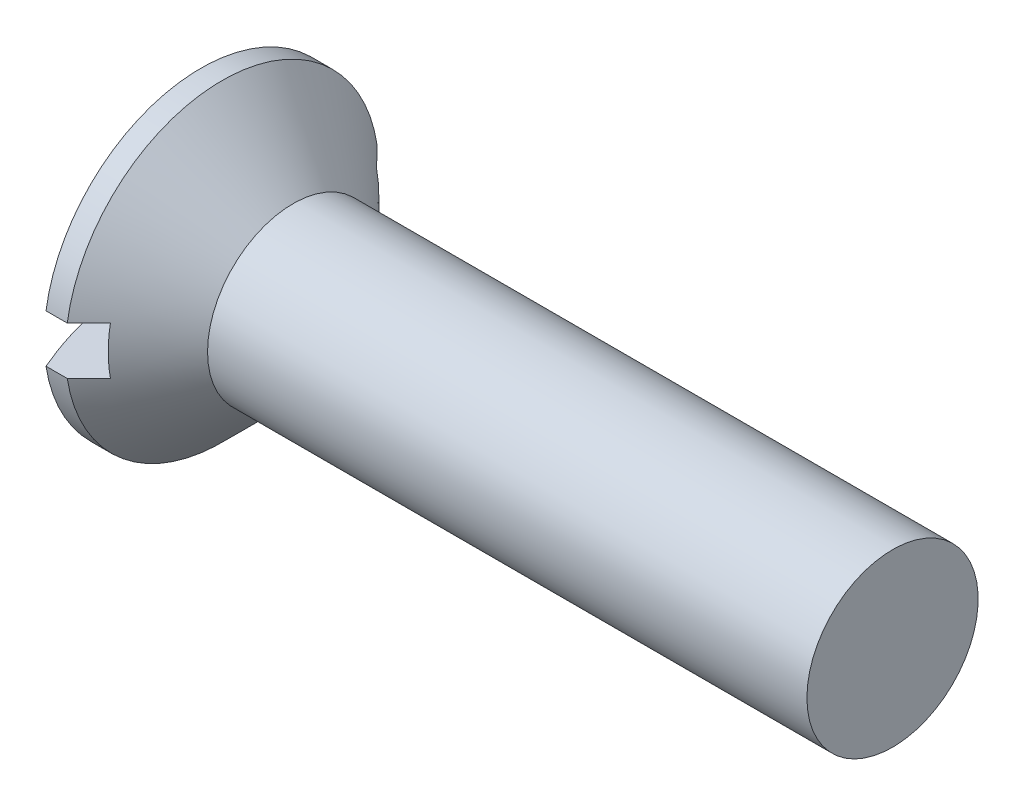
from build123d import *

# Parameters (mm, degrees)
SKETCH2_W         = 18.3
SKETCH2_H         = 2.8
SLOT_DEPTH        = 4.4
CIRPATTERN1_COUNT = 2
CIRPATTERN1_ANGLE = 90


with BuildPart() as part:
    # BodySke → Base-Revolve (revolve)
    with BuildSketch(Plane.XY, mode=Mode.PRIVATE) as base_revolve_sk:
        with BuildLine():
            Line((0, 0), (42.298786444, 0))
            Line((42.298786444, 0), (42.298786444, 5))
            Line((42.298786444, 5), (7.298786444, 5))
            Line((7.298786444, 5), (3.148786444, 9.15))
            Line((3.148786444, 9.15), (1.907441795, 9.15))
            ThreePointArc((1.907441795, 9.15), (0.481931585, 4.673350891), (0, 0))
        make_face()
    revolve(base_revolve_sk.sketch.rotate(Axis((-15.875, 0, 0), (1, 0, 0)), 90), axis=Axis((-15.875, 0, 0), (1, 0, 0)))

    # Sketch2 → Slot (cut)
    with BuildSketch(Plane(origin=(0, 0, 0), x_dir=(0, 0, -1), z_dir=(1, 0, 0))):
        Rectangle(SKETCH2_W, SKETCH2_H)
    extrude(amount=SLOT_DEPTH, mode=Mode.SUBTRACT)

    # Sketch3 → Cross section 0
    with BuildSketch(Plane(origin=(0, 0, 0), x_dir=(0, 0, -1), z_dir=(1, 0, 0))):
        with BuildLine():
            Line((1.085, -5.62), (-1.085, -5.62))
            Line((-1.085, -5.62), (-1.085, 5.62))
            Line((-1.085, 5.62), (1.085, 5.62))
            Line((1.085, 5.62), (1.085, -5.62))
        make_face()
    # Sketch4 → Cross section 1
    with BuildSketch(Plane(origin=(7.15, 0, 0), x_dir=(0, 0, -1), z_dir=(1, 0, 0))):
        with BuildLine():
            Line((0.5425, -0.5425), (-0.5425, -0.5425))
            Line((-0.5425, -0.5425), (-0.5425, 0.5425))
            Line((-0.5425, 0.5425), (0.5425, 0.5425))
            Line((0.5425, 0.5425), (0.5425, -0.5425))
        make_face()
    cross = loft(mode=Mode.SUBTRACT)

    # CirPattern1: Cross ×2 about axis
    cirpattern1_axis = Axis((0, 0, 0), (1, 0, 0))
    for i in range(1, CIRPATTERN1_COUNT):
        add(cross.rotate(cirpattern1_axis, i * CIRPATTERN1_ANGLE / (CIRPATTERN1_COUNT - 1)), mode=Mode.SUBTRACT)


solid = part.part
